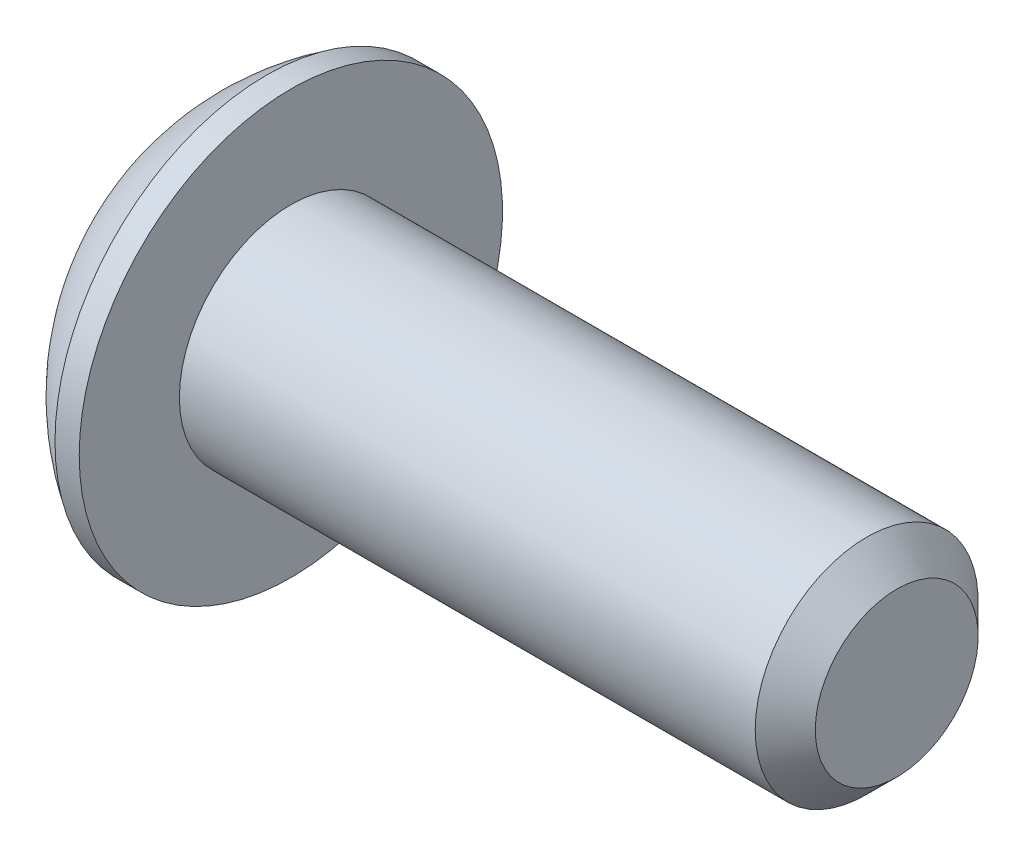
ISO-10303-21;
HEADER;
FILE_DESCRIPTION(('STEP AP214'),'2;1');
FILE_NAME('part.step','',(''),(''),'','','');
FILE_SCHEMA(('AUTOMOTIVE_DESIGN { 1 0 10303 214 1 1 1 1 }'));
ENDSEC;
DATA;
#1=APPLICATION_CONTEXT('core data for automotive mechanical design processes');
#2=APPLICATION_PROTOCOL_DEFINITION('international standard','automotive_design',2000,#1);
#3=PRODUCT_CONTEXT('',#1,'mechanical');
#4=PRODUCT('Part','Part','',(#3));
#5=PRODUCT_RELATED_PRODUCT_CATEGORY('part','',(#4));
#6=PRODUCT_DEFINITION_FORMATION('','',#4);
#7=PRODUCT_DEFINITION_CONTEXT('part definition',#1,'design');
#8=PRODUCT_DEFINITION('design','',#6,#7);
#9=PRODUCT_DEFINITION_SHAPE('','',#8);
#10=(LENGTH_UNIT() NAMED_UNIT(*) SI_UNIT(.MILLI.,.METRE.));
#11=(NAMED_UNIT(*) PLANE_ANGLE_UNIT() SI_UNIT($,.RADIAN.));
#12=(NAMED_UNIT(*) SI_UNIT($,.STERADIAN.) SOLID_ANGLE_UNIT());
#13=UNCERTAINTY_MEASURE_WITH_UNIT(LENGTH_MEASURE(1.E-05),#10,'distance_accuracy_value','');
#14=(GEOMETRIC_REPRESENTATION_CONTEXT(3) GLOBAL_UNCERTAINTY_ASSIGNED_CONTEXT((#13)) GLOBAL_UNIT_ASSIGNED_CONTEXT((#10,
#11,#12)) REPRESENTATION_CONTEXT('',''));
#15=CARTESIAN_POINT('',(0.,0.,0.));
#16=DIRECTION('',(0.,0.,1.));
#17=DIRECTION('',(1.,0.,0.));
#18=AXIS2_PLACEMENT_3D('',#15,#16,#17);
#19=CARTESIAN_POINT('',(0.,0.,0.));
#20=DIRECTION('',(-1.,0.,0.));
#21=DIRECTION('',(0.,0.,1.));
#22=AXIS2_PLACEMENT_3D('',#19,#20,#21);
#23=PLANE('',#22);
#24=CARTESIAN_POINT('',(0.,0.,0.));
#25=DIRECTION('',(-1.,0.,0.));
#26=DIRECTION('',(0.,0.,1.));
#27=AXIS2_PLACEMENT_3D('',#24,#25,#26);
#28=CIRCLE('',#27,1.6637);
#29=CARTESIAN_POINT('',(0.,1.6637,0.));
#30=VERTEX_POINT('',#29);
#31=EDGE_CURVE('E11',#30,#30,#28,.T.);
#32=ORIENTED_EDGE('',*,*,#31,.T.);
#33=EDGE_LOOP('',(#32));
#34=FACE_BOUND('',#33,.T.);
#35=DIRECTION('',(0.,-1.,0.));
#36=VECTOR('',#35,1.);
#37=CARTESIAN_POINT('',(0.,-0.571923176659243,0.9906));
#38=LINE('',#37,#36);
#39=CARTESIAN_POINT('',(0.,0.571923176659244,0.990600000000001));
#40=VERTEX_POINT('',#39);
#41=CARTESIAN_POINT('',(0.,-0.571923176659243,0.9906));
#42=VERTEX_POINT('',#41);
#43=EDGE_CURVE('E46',#40,#42,#38,.T.);
#44=ORIENTED_EDGE('',*,*,#43,.T.);
#45=DIRECTION('',(0.,-0.499999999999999,-0.866025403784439));
#46=VECTOR('',#45,1.);
#47=CARTESIAN_POINT('',(0.,-1.14384635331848,0.));
#48=LINE('',#47,#46);
#49=CARTESIAN_POINT('',(0.,-1.14384635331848,0.));
#50=VERTEX_POINT('',#49);
#51=EDGE_CURVE('E364',#42,#50,#48,.T.);
#52=ORIENTED_EDGE('',*,*,#51,.T.);
#53=DIRECTION('',(0.,0.499999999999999,-0.866025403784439));
#54=VECTOR('',#53,1.);
#55=CARTESIAN_POINT('',(0.,-0.571923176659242,-0.9906));
#56=LINE('',#55,#54);
#57=CARTESIAN_POINT('',(0.,-0.571923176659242,-0.9906));
#58=VERTEX_POINT('',#57);
#59=EDGE_CURVE('E126',#50,#58,#56,.T.);
#60=ORIENTED_EDGE('',*,*,#59,.T.);
#61=DIRECTION('',(0.,1.,0.));
#62=VECTOR('',#61,1.);
#63=CARTESIAN_POINT('',(0.,0.571923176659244,-0.9906));
#64=LINE('',#63,#62);
#65=CARTESIAN_POINT('',(0.,0.571923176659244,-0.9906));
#66=VERTEX_POINT('',#65);
#67=EDGE_CURVE('E367',#58,#66,#64,.T.);
#68=ORIENTED_EDGE('',*,*,#67,.T.);
#69=DIRECTION('',(0.,0.5,0.866025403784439));
#70=VECTOR('',#69,1.);
#71=CARTESIAN_POINT('',(0.,1.14384635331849,0.));
#72=LINE('',#71,#70);
#73=CARTESIAN_POINT('',(0.,1.14384635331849,0.));
#74=VERTEX_POINT('',#73);
#75=EDGE_CURVE('E369',#66,#74,#72,.T.);
#76=ORIENTED_EDGE('',*,*,#75,.T.);
#77=DIRECTION('',(0.,-0.5,0.866025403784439));
#78=VECTOR('',#77,1.);
#79=CARTESIAN_POINT('',(0.,0.571923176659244,0.990600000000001));
#80=LINE('',#79,#78);
#81=EDGE_CURVE('E371',#74,#40,#80,.T.);
#82=ORIENTED_EDGE('',*,*,#81,.T.);
#83=EDGE_LOOP('',(#44,#52,#60,#68,#76,#82));
#84=FACE_BOUND('',#83,.T.);
#85=ADVANCED_FACE('F32',(#34,#84),#23,.T.);
#86=CARTESIAN_POINT('',(3.55485043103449,0.,0.));
#87=DIRECTION('',(-1.,0.,0.));
#88=DIRECTION('',(0.,1.,0.));
#89=AXIS2_PLACEMENT_3D('',#86,#87,#88);
#90=SPHERICAL_SURFACE('',#89,3.92490245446);
#91=CARTESIAN_POINT('',(1.4732,0.,0.));
#92=DIRECTION('',(-1.,0.,0.));
#93=DIRECTION('',(0.,0.,1.));
#94=AXIS2_PLACEMENT_3D('',#91,#92,#93);
#95=CIRCLE('',#94,3.3274);
#96=CARTESIAN_POINT('',(1.4732,3.3274,0.));
#97=VERTEX_POINT('',#96);
#98=EDGE_CURVE('E39',#97,#97,#95,.T.);
#99=CARTESIAN_POINT('',(1.4732,3.3274,0.));
#100=CARTESIAN_POINT('',(1.45330383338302,3.31495281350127,0.));
#101=CARTESIAN_POINT('',(1.43351933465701,3.30232713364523,0.));
#102=CARTESIAN_POINT('',(1.39417998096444,3.27672293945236,0.));
#103=CARTESIAN_POINT('',(1.37462512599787,3.26374442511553,0.));
#104=CARTESIAN_POINT('',(1.33575136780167,3.23743871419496,0.));
#105=CARTESIAN_POINT('',(1.31643246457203,3.22411151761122,0.));
#106=CARTESIAN_POINT('',(1.27803682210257,3.19711273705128,0.));
#107=CARTESIAN_POINT('',(1.25896008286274,3.18344115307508,0.));
#108=CARTESIAN_POINT('',(1.22105490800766,3.15575799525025,0.));
#109=CARTESIAN_POINT('',(1.20222647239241,3.14174642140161,0.));
#110=CARTESIAN_POINT('',(1.1648239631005,3.11338779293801,0.));
#111=CARTESIAN_POINT('',(1.14624988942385,3.09904073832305,0.));
#112=CARTESIAN_POINT('',(1.1093620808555,3.07001576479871,0.));
#113=CARTESIAN_POINT('',(1.09104834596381,3.05533784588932,0.));
#114=CARTESIAN_POINT('',(1.05468710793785,3.02565586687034,0.));
#115=CARTESIAN_POINT('',(1.03663960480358,3.01065180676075,0.));
#116=CARTESIAN_POINT('',(1.00081663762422,2.98032237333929,0.));
#117=CARTESIAN_POINT('',(0.983041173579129,2.96499700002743,0.));
#118=CARTESIAN_POINT('',(0.947768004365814,2.93402987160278,0.));
#119=CARTESIAN_POINT('',(0.930270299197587,2.91838811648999,0.));
#120=CARTESIAN_POINT('',(0.895558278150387,2.88679325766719,0.));
#121=CARTESIAN_POINT('',(0.878343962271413,2.87084015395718,0.));
#122=CARTESIAN_POINT('',(0.844204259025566,2.83862773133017,0.));
#123=CARTESIAN_POINT('',(0.827278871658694,2.82236841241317,0.));
#124=CARTESIAN_POINT('',(0.79372247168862,2.78954879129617,0.));
#125=CARTESIAN_POINT('',(0.777091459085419,2.77298848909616,0.));
#126=CARTESIAN_POINT('',(0.744129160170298,2.73957223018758,0.));
#127=CARTESIAN_POINT('',(0.727797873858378,2.722716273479,0.));
#128=CARTESIAN_POINT('',(0.695440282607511,2.68871412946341,0.));
#129=CARTESIAN_POINT('',(0.679413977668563,2.6715679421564,0.));
#130=CARTESIAN_POINT('',(0.647671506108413,2.63699085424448,0.));
#131=CARTESIAN_POINT('',(0.631955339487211,2.61955995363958,0.));
#132=CARTESIAN_POINT('',(0.600838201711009,2.58441904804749,0.));
#133=CARTESIAN_POINT('',(0.58543723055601,2.5667090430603,0.));
#134=CARTESIAN_POINT('',(0.554955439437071,2.53101562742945,0.));
#135=CARTESIAN_POINT('',(0.539874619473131,2.51303221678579,0.));
#136=CARTESIAN_POINT('',(0.510037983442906,2.47679777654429,0.));
#137=CARTESIAN_POINT('',(0.495282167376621,2.45854674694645,0.));
#138=CARTESIAN_POINT('',(0.466100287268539,2.42178294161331,0.));
#139=CARTESIAN_POINT('',(0.451674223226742,2.40327016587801,0.));
#140=CARTESIAN_POINT('',(0.423156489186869,2.36598882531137,0.));
#141=CARTESIAN_POINT('',(0.409064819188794,2.34722026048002,0.));
#142=CARTESIAN_POINT('',(0.381220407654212,2.30943338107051,0.));
#143=CARTESIAN_POINT('',(0.367467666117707,2.29041506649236,0.));
#144=CARTESIAN_POINT('',(0.340305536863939,2.25213480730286,0.));
#145=CARTESIAN_POINT('',(0.326896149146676,2.23287286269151,0.));
#146=CARTESIAN_POINT('',(0.300425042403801,2.19411154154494,0.));
#147=CARTESIAN_POINT('',(0.287363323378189,2.17461216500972,0.));
#148=CARTESIAN_POINT('',(0.261591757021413,2.135382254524,0.));
#149=CARTESIAN_POINT('',(0.248881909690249,2.11565172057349,0.));
#150=CARTESIAN_POINT('',(0.223818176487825,2.07596584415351,0.));
#151=CARTESIAN_POINT('',(0.211464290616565,2.05601050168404,0.));
#152=CARTESIAN_POINT('',(0.187116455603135,2.01588142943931,0.));
#153=CARTESIAN_POINT('',(0.175122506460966,1.99570769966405,0.));
#154=CARTESIAN_POINT('',(0.15149840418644,1.9551483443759,0.));
#155=CARTESIAN_POINT('',(0.139868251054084,1.93476271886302,0.));
#156=CARTESIAN_POINT('',(0.116975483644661,1.89378613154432,0.));
#157=CARTESIAN_POINT('',(0.105712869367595,1.87319516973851,0.));
#158=CARTESIAN_POINT('',(0.0835588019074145,1.83181453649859,0.));
#159=CARTESIAN_POINT('',(0.0726673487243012,1.81102486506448,0.));
#160=CARTESIAN_POINT('',(0.0512591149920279,1.76925349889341,0.));
#161=CARTESIAN_POINT('',(0.0407423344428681,1.74827180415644,0.));
#162=CARTESIAN_POINT('',(0.0200868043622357,1.7061231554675,0.));
#163=CARTESIAN_POINT('',(0.00994805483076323,1.68495620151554,0.));
#164=CARTESIAN_POINT('',(0.,1.6637,0.));
#165=B_SPLINE_CURVE_WITH_KNOTS('',3,(#99,#100,#101,#102,#103,#104,#105,#106,#107,#108,#109,#110,
#111,#112,#113,#114,#115,#116,#117,#118,#119,#120,#121,#122,#123,#124,#125,#126,#127,#128,#129,
#130,#131,#132,#133,#134,#135,#136,#137,#138,#139,#140,#141,#142,#143,#144,#145,#146,#147,#148,
#149,#150,#151,#152,#153,#154,#155,#156,#157,#158,#159,#160,#161,#162,#163,#164),.UNSPECIFIED.,
.F.,.F.,(4,2,2,2,2,2,2,2,2,2,2,2,2,2,2,2,2,2,2,2,2,2,2,2,2,2,2,2,2,2,2,2,4),(0.,
0.0704057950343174,0.140811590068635,0.211217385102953,0.281623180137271,0.352028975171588,
0.422434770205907,0.492840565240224,0.563246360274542,0.633652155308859,0.704057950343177,
0.774463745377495,0.844869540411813,0.91527533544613,0.985681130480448,1.05608692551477,
1.12649272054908,1.1968985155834,1.26730431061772,1.33771010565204,1.40811590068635,
1.47852169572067,1.54892749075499,1.61933328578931,1.68973908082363,1.76014487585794,
1.83055067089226,1.90095646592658,1.9713622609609,2.04176805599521,2.11217385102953,
2.18257964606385,2.25298544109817),.UNSPECIFIED.);
#166=EDGE_CURVE('BSEAM153',#97,#30,#165,.T.);
#167=ORIENTED_EDGE('',*,*,#98,.T.);
#168=ORIENTED_EDGE('',*,*,#31,.F.);
#169=ORIENTED_EDGE('',*,*,#166,.T.);
#170=ORIENTED_EDGE('',*,*,#166,.F.);
#171=EDGE_LOOP('',(#167,#169,#168,#170));
#172=FACE_BOUND('',#171,.T.);
#173=ADVANCED_FACE('F153',(#172),#90,.T.);
#174=CARTESIAN_POINT('',(0.,0.,0.));
#175=DIRECTION('',(-1.,0.,0.));
#176=DIRECTION('',(0.,0.,1.));
#177=AXIS2_PLACEMENT_3D('',#174,#175,#176);
#178=CYLINDRICAL_SURFACE('',#177,3.3274);
#179=ORIENTED_EDGE('',*,*,#98,.F.);
#180=EDGE_LOOP('',(#179));
#181=FACE_BOUND('',#180,.T.);
#182=CARTESIAN_POINT('',(1.8542,0.,0.));
#183=DIRECTION('',(-1.,0.,0.));
#184=DIRECTION('',(0.,0.,1.));
#185=AXIS2_PLACEMENT_3D('',#182,#183,#184);
#186=CIRCLE('',#185,3.3274);
#187=CARTESIAN_POINT('',(1.8542,0.,3.3274));
#188=VERTEX_POINT('',#187);
#189=EDGE_CURVE('E148',#188,#188,#186,.T.);
#190=ORIENTED_EDGE('',*,*,#189,.T.);
#191=EDGE_LOOP('',(#190));
#192=FACE_BOUND('',#191,.T.);
#193=ADVANCED_FACE('F156',(#181,#192),#178,.T.);
#194=CARTESIAN_POINT('',(1.8542,1.7526,0.));
#195=DIRECTION('',(-1.,0.,0.));
#196=DIRECTION('',(0.,0.,1.));
#197=AXIS2_PLACEMENT_3D('',#194,#195,#196);
#198=PLANE('',#197);
#199=ORIENTED_EDGE('',*,*,#189,.F.);
#200=EDGE_LOOP('',(#199));
#201=FACE_BOUND('',#200,.T.);
#202=CARTESIAN_POINT('',(1.8542,0.,0.));
#203=DIRECTION('',(-1.,0.,0.));
#204=DIRECTION('',(0.,0.,1.));
#205=AXIS2_PLACEMENT_3D('',#202,#203,#204);
#206=CIRCLE('',#205,1.7526);
#207=CARTESIAN_POINT('',(1.8542,0.,1.7526));
#208=VERTEX_POINT('',#207);
#209=EDGE_CURVE('E145',#208,#208,#206,.T.);
#210=ORIENTED_EDGE('',*,*,#209,.T.);
#211=EDGE_LOOP('',(#210));
#212=FACE_BOUND('',#211,.T.);
#213=ADVANCED_FACE('F159',(#201,#212),#198,.F.);
#214=CARTESIAN_POINT('',(0.,0.,0.));
#215=DIRECTION('',(-1.,0.,0.));
#216=DIRECTION('',(0.,0.,1.));
#217=AXIS2_PLACEMENT_3D('',#214,#215,#216);
#218=CYLINDRICAL_SURFACE('',#217,1.7526);
#219=ORIENTED_EDGE('',*,*,#209,.F.);
#220=EDGE_LOOP('',(#219));
#221=FACE_BOUND('',#220,.T.);
#222=CARTESIAN_POINT('',(10.90676,0.,0.));
#223=DIRECTION('',(-1.,0.,0.));
#224=DIRECTION('',(0.,0.,1.));
#225=AXIS2_PLACEMENT_3D('',#222,#223,#224);
#226=CIRCLE('',#225,1.7526);
#227=CARTESIAN_POINT('',(10.90676,0.,1.7526));
#228=VERTEX_POINT('',#227);
#229=EDGE_CURVE('E142',#228,#228,#226,.T.);
#230=ORIENTED_EDGE('',*,*,#229,.T.);
#231=EDGE_LOOP('',(#230));
#232=FACE_BOUND('',#231,.T.);
#233=ADVANCED_FACE('F165',(#221,#232),#218,.T.);
#234=CARTESIAN_POINT('',(11.3792,0.,0.));
#235=DIRECTION('',(-1.,0.,0.));
#236=DIRECTION('',(0.,0.,1.));
#237=AXIS2_PLACEMENT_3D('',#234,#235,#236);
#238=CONICAL_SURFACE('',#237,1.28016,0.78539816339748);
#239=ORIENTED_EDGE('',*,*,#229,.F.);
#240=EDGE_LOOP('',(#239));
#241=FACE_BOUND('',#240,.T.);
#242=CARTESIAN_POINT('',(11.3792,0.,0.));
#243=DIRECTION('',(-1.,0.,0.));
#244=DIRECTION('',(0.,0.,1.));
#245=AXIS2_PLACEMENT_3D('',#242,#243,#244);
#246=CIRCLE('',#245,1.28016);
#247=CARTESIAN_POINT('',(11.3792,0.,1.28016));
#248=VERTEX_POINT('',#247);
#249=EDGE_CURVE('E138',#248,#248,#246,.T.);
#250=ORIENTED_EDGE('',*,*,#249,.T.);
#251=EDGE_LOOP('',(#250));
#252=FACE_BOUND('',#251,.T.);
#253=ADVANCED_FACE('F171',(#241,#252),#238,.T.);
#254=CARTESIAN_POINT('',(11.3792,0.,0.));
#255=DIRECTION('',(-1.,0.,0.));
#256=DIRECTION('',(0.,0.,1.));
#257=AXIS2_PLACEMENT_3D('',#254,#255,#256);
#258=PLANE('',#257);
#259=ORIENTED_EDGE('',*,*,#249,.F.);
#260=EDGE_LOOP('',(#259));
#261=FACE_BOUND('',#260,.T.);
#262=ADVANCED_FACE('F177',(#261),#258,.F.);
#263=CARTESIAN_POINT('',(1.1176,-1.14384635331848,0.));
#264=DIRECTION('',(0.,0.866025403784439,-0.499999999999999));
#265=DIRECTION('',(0.,0.499999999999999,0.866025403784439));
#266=AXIS2_PLACEMENT_3D('',#263,#264,#265);
#267=PLANE('',#266);
#268=DIRECTION('',(0.,-0.499999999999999,-0.866025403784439));
#269=VECTOR('',#268,1.);
#270=CARTESIAN_POINT('',(1.1176,-1.14384635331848,0.));
#271=LINE('',#270,#269);
#272=CARTESIAN_POINT('',(1.1176,-0.571923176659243,0.9906));
#273=VERTEX_POINT('',#272);
#274=CARTESIAN_POINT('',(1.1176,-0.857884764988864,0.495299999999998));
#275=VERTEX_POINT('',#274);
#276=EDGE_CURVE('E112',#273,#275,#271,.T.);
#277=ORIENTED_EDGE('',*,*,#276,.T.);
#278=CARTESIAN_POINT('',(1.1176,-1.14384635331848,0.));
#279=VERTEX_POINT('',#278);
#280=EDGE_CURVE('E107',#275,#279,#271,.T.);
#281=ORIENTED_EDGE('',*,*,#280,.T.);
#282=DIRECTION('',(-1.,0.,0.));
#283=VECTOR('',#282,1.);
#284=CARTESIAN_POINT('',(1.1176,-1.14384635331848,0.));
#285=LINE('',#284,#283);
#286=EDGE_CURVE('E109',#279,#50,#285,.T.);
#287=ORIENTED_EDGE('',*,*,#286,.T.);
#288=ORIENTED_EDGE('',*,*,#51,.F.);
#289=DIRECTION('',(-1.,0.,0.));
#290=VECTOR('',#289,1.);
#291=CARTESIAN_POINT('',(1.1176,-0.571923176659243,0.9906));
#292=LINE('',#291,#290);
#293=EDGE_CURVE('E359',#273,#42,#292,.T.);
#294=ORIENTED_EDGE('',*,*,#293,.F.);
#295=EDGE_LOOP('',(#277,#281,#287,#288,#294));
#296=FACE_BOUND('',#295,.T.);
#297=ADVANCED_FACE('F108',(#296),#267,.T.);
#298=CARTESIAN_POINT('',(1.1176,-0.571923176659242,-0.9906));
#299=DIRECTION('',(0.,0.866025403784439,0.499999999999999));
#300=DIRECTION('',(0.,-0.499999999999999,0.866025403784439));
#301=AXIS2_PLACEMENT_3D('',#298,#299,#300);
#302=PLANE('',#301);
#303=DIRECTION('',(0.,0.499999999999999,-0.866025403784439));
#304=VECTOR('',#303,1.);
#305=CARTESIAN_POINT('',(1.1176,-0.571923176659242,-0.9906));
#306=LINE('',#305,#304);
#307=CARTESIAN_POINT('',(1.1176,-0.857884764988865,-0.495299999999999));
#308=VERTEX_POINT('',#307);
#309=EDGE_CURVE('E54',#279,#308,#306,.T.);
#310=ORIENTED_EDGE('',*,*,#309,.T.);
#311=CARTESIAN_POINT('',(1.1176,-0.571923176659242,-0.9906));
#312=VERTEX_POINT('',#311);
#313=EDGE_CURVE('E121',#308,#312,#306,.T.);
#314=ORIENTED_EDGE('',*,*,#313,.T.);
#315=DIRECTION('',(-1.,0.,0.));
#316=VECTOR('',#315,1.);
#317=CARTESIAN_POINT('',(1.1176,-0.571923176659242,-0.9906));
#318=LINE('',#317,#316);
#319=EDGE_CURVE('E128',#312,#58,#318,.T.);
#320=ORIENTED_EDGE('',*,*,#319,.T.);
#321=ORIENTED_EDGE('',*,*,#59,.F.);
#322=ORIENTED_EDGE('',*,*,#286,.F.);
#323=EDGE_LOOP('',(#310,#314,#320,#321,#322));
#324=FACE_BOUND('',#323,.T.);
#325=ADVANCED_FACE('F124',(#324),#302,.T.);
#326=CARTESIAN_POINT('',(1.1176,0.571923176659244,-0.9906));
#327=DIRECTION('',(0.,0.,1.));
#328=DIRECTION('',(1.,0.,0.));
#329=AXIS2_PLACEMENT_3D('',#326,#327,#328);
#330=PLANE('',#329);
#331=DIRECTION('',(0.,1.,0.));
#332=VECTOR('',#331,1.);
#333=CARTESIAN_POINT('',(1.1176,0.571923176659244,-0.9906));
#334=LINE('',#333,#332);
#335=CARTESIAN_POINT('',(1.1176,0.,-0.9906));
#336=VERTEX_POINT('',#335);
#337=EDGE_CURVE('E389',#312,#336,#334,.T.);
#338=ORIENTED_EDGE('',*,*,#337,.T.);
#339=CARTESIAN_POINT('',(1.1176,0.571923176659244,-0.9906));
#340=VERTEX_POINT('',#339);
#341=EDGE_CURVE('E120',#336,#340,#334,.T.);
#342=ORIENTED_EDGE('',*,*,#341,.T.);
#343=DIRECTION('',(-1.,0.,0.));
#344=VECTOR('',#343,1.);
#345=CARTESIAN_POINT('',(1.1176,0.571923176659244,-0.9906));
#346=LINE('',#345,#344);
#347=EDGE_CURVE('E133',#340,#66,#346,.T.);
#348=ORIENTED_EDGE('',*,*,#347,.T.);
#349=ORIENTED_EDGE('',*,*,#67,.F.);
#350=ORIENTED_EDGE('',*,*,#319,.F.);
#351=EDGE_LOOP('',(#338,#342,#348,#349,#350));
#352=FACE_BOUND('',#351,.T.);
#353=ADVANCED_FACE('F238',(#352),#330,.T.);
#354=CARTESIAN_POINT('',(1.1176,1.14384635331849,0.));
#355=DIRECTION('',(0.,-0.866025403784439,0.5));
#356=DIRECTION('',(0.,-0.5,-0.866025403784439));
#357=AXIS2_PLACEMENT_3D('',#354,#355,#356);
#358=PLANE('',#357);
#359=DIRECTION('',(0.,0.5,0.866025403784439));
#360=VECTOR('',#359,1.);
#361=CARTESIAN_POINT('',(1.1176,1.14384635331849,0.));
#362=LINE('',#361,#360);
#363=CARTESIAN_POINT('',(1.1176,0.857884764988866,-0.495300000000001));
#364=VERTEX_POINT('',#363);
#365=EDGE_CURVE('E393',#340,#364,#362,.T.);
#366=ORIENTED_EDGE('',*,*,#365,.T.);
#367=CARTESIAN_POINT('',(1.1176,1.14384635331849,0.));
#368=VERTEX_POINT('',#367);
#369=EDGE_CURVE('E391',#364,#368,#362,.T.);
#370=ORIENTED_EDGE('',*,*,#369,.T.);
#371=DIRECTION('',(-1.,0.,0.));
#372=VECTOR('',#371,1.);
#373=CARTESIAN_POINT('',(1.1176,1.14384635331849,0.));
#374=LINE('',#373,#372);
#375=EDGE_CURVE('E375',#368,#74,#374,.T.);
#376=ORIENTED_EDGE('',*,*,#375,.T.);
#377=ORIENTED_EDGE('',*,*,#75,.F.);
#378=ORIENTED_EDGE('',*,*,#347,.F.);
#379=EDGE_LOOP('',(#366,#370,#376,#377,#378));
#380=FACE_BOUND('',#379,.T.);
#381=ADVANCED_FACE('F247',(#380),#358,.T.);
#382=CARTESIAN_POINT('',(1.1176,0.571923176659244,0.990600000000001));
#383=DIRECTION('',(0.,-0.866025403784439,-0.5));
#384=DIRECTION('',(0.,0.5,-0.866025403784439));
#385=AXIS2_PLACEMENT_3D('',#382,#383,#384);
#386=PLANE('',#385);
#387=DIRECTION('',(0.,-0.5,0.866025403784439));
#388=VECTOR('',#387,1.);
#389=CARTESIAN_POINT('',(1.1176,0.571923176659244,0.990600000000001));
#390=LINE('',#389,#388);
#391=CARTESIAN_POINT('',(1.1176,0.857884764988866,0.495300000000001));
#392=VERTEX_POINT('',#391);
#393=EDGE_CURVE('E354',#368,#392,#390,.T.);
#394=ORIENTED_EDGE('',*,*,#393,.T.);
#395=CARTESIAN_POINT('',(1.1176,0.571923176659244,0.990600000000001));
#396=VERTEX_POINT('',#395);
#397=EDGE_CURVE('E350',#392,#396,#390,.T.);
#398=ORIENTED_EDGE('',*,*,#397,.T.);
#399=DIRECTION('',(-1.,0.,0.));
#400=VECTOR('',#399,1.);
#401=CARTESIAN_POINT('',(1.1176,0.571923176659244,0.990600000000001));
#402=LINE('',#401,#400);
#403=EDGE_CURVE('E358',#396,#40,#402,.T.);
#404=ORIENTED_EDGE('',*,*,#403,.T.);
#405=ORIENTED_EDGE('',*,*,#81,.F.);
#406=ORIENTED_EDGE('',*,*,#375,.F.);
#407=EDGE_LOOP('',(#394,#398,#404,#405,#406));
#408=FACE_BOUND('',#407,.T.);
#409=ADVANCED_FACE('F257',(#408),#386,.T.);
#410=CARTESIAN_POINT('',(1.1176,-0.571923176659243,0.9906));
#411=DIRECTION('',(0.,0.,-1.));
#412=DIRECTION('',(0.,1.,0.));
#413=AXIS2_PLACEMENT_3D('',#410,#411,#412);
#414=PLANE('',#413);
#415=DIRECTION('',(0.,-1.,0.));
#416=VECTOR('',#415,1.);
#417=CARTESIAN_POINT('',(1.1176,-0.571923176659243,0.9906));
#418=LINE('',#417,#416);
#419=CARTESIAN_POINT('',(1.1176,0.,0.9906));
#420=VERTEX_POINT('',#419);
#421=EDGE_CURVE('E349',#396,#420,#418,.T.);
#422=ORIENTED_EDGE('',*,*,#421,.T.);
#423=EDGE_CURVE('E352',#420,#273,#418,.T.);
#424=ORIENTED_EDGE('',*,*,#423,.T.);
#425=ORIENTED_EDGE('',*,*,#293,.T.);
#426=ORIENTED_EDGE('',*,*,#43,.F.);
#427=ORIENTED_EDGE('',*,*,#403,.F.);
#428=EDGE_LOOP('',(#422,#424,#425,#426,#427));
#429=FACE_BOUND('',#428,.T.);
#430=ADVANCED_FACE('F267',(#429),#414,.T.);
#431=CARTESIAN_POINT('',(1.1176,-1.71576952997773,-0.9906));
#432=DIRECTION('',(1.,0.,0.));
#433=DIRECTION('',(0.,0.,-1.));
#434=AXIS2_PLACEMENT_3D('',#431,#432,#433);
#435=PLANE('',#434);
#436=CARTESIAN_POINT('',(1.1176,0.,0.));
#437=DIRECTION('',(-1.,0.,0.));
#438=DIRECTION('',(0.,0.,1.));
#439=AXIS2_PLACEMENT_3D('',#436,#437,#438);
#440=CIRCLE('',#439,0.9906);
#441=EDGE_CURVE('E396',#364,#336,#440,.T.);
#442=ORIENTED_EDGE('',*,*,#441,.F.);
#443=ORIENTED_EDGE('',*,*,#365,.F.);
#444=ORIENTED_EDGE('',*,*,#341,.F.);
#445=EDGE_LOOP('',(#442,#443,#444));
#446=FACE_BOUND('',#445,.T.);
#447=ADVANCED_FACE('F277',(#446),#435,.F.);
#448=EDGE_CURVE('E139',#392,#364,#440,.T.);
#449=ORIENTED_EDGE('',*,*,#448,.F.);
#450=ORIENTED_EDGE('',*,*,#393,.F.);
#451=ORIENTED_EDGE('',*,*,#369,.F.);
#452=EDGE_LOOP('',(#449,#450,#451));
#453=FACE_BOUND('',#452,.T.);
#454=ADVANCED_FACE('F287',(#453),#435,.F.);
#455=EDGE_CURVE('E132',#420,#392,#440,.T.);
#456=ORIENTED_EDGE('',*,*,#455,.F.);
#457=ORIENTED_EDGE('',*,*,#421,.F.);
#458=ORIENTED_EDGE('',*,*,#397,.F.);
#459=EDGE_LOOP('',(#456,#457,#458));
#460=FACE_BOUND('',#459,.T.);
#461=ADVANCED_FACE('F298',(#460),#435,.F.);
#462=EDGE_CURVE('E127',#275,#420,#440,.T.);
#463=ORIENTED_EDGE('',*,*,#462,.F.);
#464=ORIENTED_EDGE('',*,*,#276,.F.);
#465=ORIENTED_EDGE('',*,*,#423,.F.);
#466=EDGE_LOOP('',(#463,#464,#465));
#467=FACE_BOUND('',#466,.T.);
#468=ADVANCED_FACE('F307',(#467),#435,.F.);
#469=EDGE_CURVE('E118',#308,#275,#440,.T.);
#470=ORIENTED_EDGE('',*,*,#469,.F.);
#471=ORIENTED_EDGE('',*,*,#309,.F.);
#472=ORIENTED_EDGE('',*,*,#280,.F.);
#473=EDGE_LOOP('',(#470,#471,#472));
#474=FACE_BOUND('',#473,.T.);
#475=ADVANCED_FACE('F117',(#474),#435,.F.);
#476=EDGE_CURVE('E390',#336,#308,#440,.T.);
#477=ORIENTED_EDGE('',*,*,#476,.F.);
#478=ORIENTED_EDGE('',*,*,#337,.F.);
#479=ORIENTED_EDGE('',*,*,#313,.F.);
#480=EDGE_LOOP('',(#477,#478,#479));
#481=FACE_BOUND('',#480,.T.);
#482=ADVANCED_FACE('F290',(#481),#435,.F.);
#483=CARTESIAN_POINT('',(1.68952317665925,0.,0.));
#484=DIRECTION('',(-1.,0.,0.));
#485=DIRECTION('',(0.,0.,1.));
#486=AXIS2_PLACEMENT_3D('',#483,#484,#485);
#487=CONICAL_SURFACE('',#486,0.,1.04719755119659);
#488=ORIENTED_EDGE('',*,*,#455,.T.);
#489=ORIENTED_EDGE('',*,*,#448,.T.);
#490=ORIENTED_EDGE('',*,*,#441,.T.);
#491=ORIENTED_EDGE('',*,*,#476,.T.);
#492=ORIENTED_EDGE('',*,*,#469,.T.);
#493=ORIENTED_EDGE('',*,*,#462,.T.);
#494=EDGE_LOOP('',(#488,#489,#490,#491,#492,#493));
#495=FACE_BOUND('',#494,.T.);
#496=CARTESIAN_POINT('',(1.68952317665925,0.,0.));
#497=VERTEX_POINT('',#496);
#498=VERTEX_LOOP('',#497);
#499=FACE_BOUND('',#498,.T.);
#500=ADVANCED_FACE('F331',(#495,#499),#487,.F.);
#501=CLOSED_SHELL('',(#85,#173,#193,#213,#233,#253,#262,#297,#325,#353,#381,#409,#430,#447,#454,
#461,#468,#475,#482,#500));
#502=MANIFOLD_SOLID_BREP('B2',#501);
#503=ADVANCED_BREP_SHAPE_REPRESENTATION('',(#18,#502),#14);
#504=SHAPE_DEFINITION_REPRESENTATION(#9,#503);
ENDSEC;
END-ISO-10303-21;
